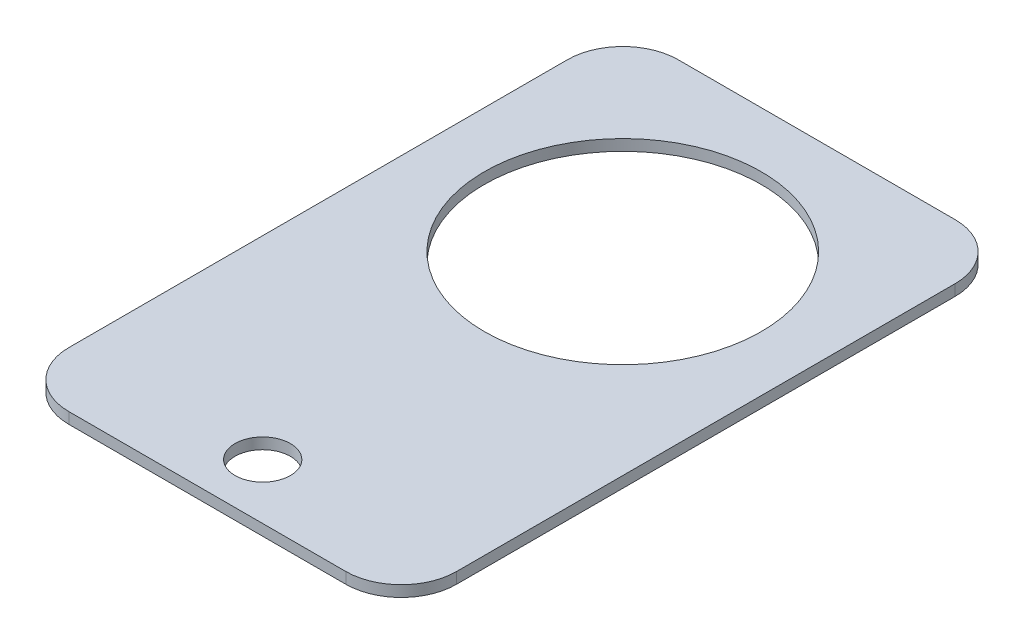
ISO-10303-21;
HEADER;
FILE_DESCRIPTION(('STEP AP214'),'2;1');
FILE_NAME('part.step','',(''),(''),'','','');
FILE_SCHEMA(('AUTOMOTIVE_DESIGN { 1 0 10303 214 1 1 1 1 }'));
ENDSEC;
DATA;
#1=APPLICATION_CONTEXT('core data for automotive mechanical design processes');
#2=APPLICATION_PROTOCOL_DEFINITION('international standard','automotive_design',2000,#1);
#3=PRODUCT_CONTEXT('',#1,'mechanical');
#4=PRODUCT('Part','Part','',(#3));
#5=PRODUCT_RELATED_PRODUCT_CATEGORY('part','',(#4));
#6=PRODUCT_DEFINITION_FORMATION('','',#4);
#7=PRODUCT_DEFINITION_CONTEXT('part definition',#1,'design');
#8=PRODUCT_DEFINITION('design','',#6,#7);
#9=PRODUCT_DEFINITION_SHAPE('','',#8);
#10=(LENGTH_UNIT() NAMED_UNIT(*) SI_UNIT(.MILLI.,.METRE.));
#11=(NAMED_UNIT(*) PLANE_ANGLE_UNIT() SI_UNIT($,.RADIAN.));
#12=(NAMED_UNIT(*) SI_UNIT($,.STERADIAN.) SOLID_ANGLE_UNIT());
#13=UNCERTAINTY_MEASURE_WITH_UNIT(LENGTH_MEASURE(1.E-05),#10,'distance_accuracy_value','');
#14=(GEOMETRIC_REPRESENTATION_CONTEXT(3) GLOBAL_UNCERTAINTY_ASSIGNED_CONTEXT((#13)) GLOBAL_UNIT_ASSIGNED_CONTEXT((#10,
#11,#12)) REPRESENTATION_CONTEXT('',''));
#15=CARTESIAN_POINT('',(0.,0.,0.));
#16=DIRECTION('',(0.,0.,1.));
#17=DIRECTION('',(1.,0.,0.));
#18=AXIS2_PLACEMENT_3D('',#15,#16,#17);
#19=CARTESIAN_POINT('',(0.,2.,0.));
#20=DIRECTION('',(1.,0.,0.));
#21=DIRECTION('',(0.,0.,-1.));
#22=AXIS2_PLACEMENT_3D('',#19,#20,#21);
#23=PLANE('',#22);
#24=DIRECTION('',(0.,0.,1.));
#25=VECTOR('',#24,1.);
#26=CARTESIAN_POINT('',(0.,2.,0.));
#27=LINE('',#26,#25);
#28=CARTESIAN_POINT('',(0.,2.,-100.));
#29=VERTEX_POINT('',#28);
#30=CARTESIAN_POINT('',(0.,2.,-10.));
#31=VERTEX_POINT('',#30);
#32=EDGE_CURVE('E134',#29,#31,#27,.T.);
#33=ORIENTED_EDGE('',*,*,#32,.F.);
#34=DIRECTION('',(0.,-1.,0.));
#35=VECTOR('',#34,1.);
#36=CARTESIAN_POINT('',(0.,2.,-100.));
#37=LINE('',#36,#35);
#38=CARTESIAN_POINT('',(0.,0.,-100.));
#39=VERTEX_POINT('',#38);
#40=EDGE_CURVE('E173',#29,#39,#37,.T.);
#41=ORIENTED_EDGE('',*,*,#40,.T.);
#42=DIRECTION('',(0.,0.,1.));
#43=VECTOR('',#42,1.);
#44=CARTESIAN_POINT('',(0.,0.,0.));
#45=LINE('',#44,#43);
#46=CARTESIAN_POINT('',(0.,0.,-10.));
#47=VERTEX_POINT('',#46);
#48=EDGE_CURVE('E188',#39,#47,#45,.T.);
#49=ORIENTED_EDGE('',*,*,#48,.T.);
#50=DIRECTION('',(0.,-1.,0.));
#51=VECTOR('',#50,1.);
#52=CARTESIAN_POINT('',(0.,2.,-10.));
#53=LINE('',#52,#51);
#54=EDGE_CURVE('E170',#47,#31,#53,.F.);
#55=ORIENTED_EDGE('',*,*,#54,.T.);
#56=EDGE_LOOP('',(#33,#41,#49,#55));
#57=FACE_BOUND('',#56,.T.);
#58=ADVANCED_FACE('F38',(#57),#23,.F.);
#59=CARTESIAN_POINT('',(0.,2.,0.));
#60=DIRECTION('',(0.,0.,-1.));
#61=DIRECTION('',(-1.,0.,0.));
#62=AXIS2_PLACEMENT_3D('',#59,#60,#61);
#63=PLANE('',#62);
#64=DIRECTION('',(1.,0.,0.));
#65=VECTOR('',#64,1.);
#66=CARTESIAN_POINT('',(0.,2.,0.));
#67=LINE('',#66,#65);
#68=CARTESIAN_POINT('',(10.,2.,0.));
#69=VERTEX_POINT('',#68);
#70=CARTESIAN_POINT('',(60.,2.,0.));
#71=VERTEX_POINT('',#70);
#72=EDGE_CURVE('E139',#69,#71,#67,.T.);
#73=ORIENTED_EDGE('',*,*,#72,.F.);
#74=DIRECTION('',(0.,-1.,0.));
#75=VECTOR('',#74,1.);
#76=CARTESIAN_POINT('',(10.,2.,0.));
#77=LINE('',#76,#75);
#78=CARTESIAN_POINT('',(10.,0.,0.));
#79=VERTEX_POINT('',#78);
#80=EDGE_CURVE('E11',#69,#79,#77,.T.);
#81=ORIENTED_EDGE('',*,*,#80,.T.);
#82=DIRECTION('',(1.,0.,0.));
#83=VECTOR('',#82,1.);
#84=CARTESIAN_POINT('',(0.,0.,0.));
#85=LINE('',#84,#83);
#86=CARTESIAN_POINT('',(60.,0.,0.));
#87=VERTEX_POINT('',#86);
#88=EDGE_CURVE('E141',#79,#87,#85,.T.);
#89=ORIENTED_EDGE('',*,*,#88,.T.);
#90=DIRECTION('',(0.,-1.,0.));
#91=VECTOR('',#90,1.);
#92=CARTESIAN_POINT('',(60.,2.,0.));
#93=LINE('',#92,#91);
#94=EDGE_CURVE('E47',#87,#71,#93,.F.);
#95=ORIENTED_EDGE('',*,*,#94,.T.);
#96=EDGE_LOOP('',(#73,#81,#89,#95));
#97=FACE_BOUND('',#96,.T.);
#98=ADVANCED_FACE('F194',(#97),#63,.F.);
#99=CARTESIAN_POINT('',(70.,2.,0.));
#100=DIRECTION('',(-1.,0.,0.));
#101=DIRECTION('',(0.,0.,1.));
#102=AXIS2_PLACEMENT_3D('',#99,#100,#101);
#103=PLANE('',#102);
#104=DIRECTION('',(0.,0.,-1.));
#105=VECTOR('',#104,1.);
#106=CARTESIAN_POINT('',(70.,0.,0.));
#107=LINE('',#106,#105);
#108=CARTESIAN_POINT('',(70.,0.,-10.));
#109=VERTEX_POINT('',#108);
#110=CARTESIAN_POINT('',(70.,0.,-100.));
#111=VERTEX_POINT('',#110);
#112=EDGE_CURVE('E135',#109,#111,#107,.T.);
#113=ORIENTED_EDGE('',*,*,#112,.T.);
#114=DIRECTION('',(0.,-1.,0.));
#115=VECTOR('',#114,1.);
#116=CARTESIAN_POINT('',(70.,2.,-100.));
#117=LINE('',#116,#115);
#118=CARTESIAN_POINT('',(70.,2.,-100.));
#119=VERTEX_POINT('',#118);
#120=EDGE_CURVE('E110',#111,#119,#117,.F.);
#121=ORIENTED_EDGE('',*,*,#120,.T.);
#122=DIRECTION('',(0.,0.,-1.));
#123=VECTOR('',#122,1.);
#124=CARTESIAN_POINT('',(70.,2.,0.));
#125=LINE('',#124,#123);
#126=CARTESIAN_POINT('',(70.,2.,-10.));
#127=VERTEX_POINT('',#126);
#128=EDGE_CURVE('E179',#127,#119,#125,.T.);
#129=ORIENTED_EDGE('',*,*,#128,.F.);
#130=DIRECTION('',(0.,-1.,0.));
#131=VECTOR('',#130,1.);
#132=CARTESIAN_POINT('',(70.,2.,-10.));
#133=LINE('',#132,#131);
#134=EDGE_CURVE('E116',#127,#109,#133,.T.);
#135=ORIENTED_EDGE('',*,*,#134,.T.);
#136=EDGE_LOOP('',(#113,#121,#129,#135));
#137=FACE_BOUND('',#136,.T.);
#138=ADVANCED_FACE('F201',(#137),#103,.F.);
#139=CARTESIAN_POINT('',(0.,2.,-110.));
#140=DIRECTION('',(0.,0.,1.));
#141=DIRECTION('',(1.,0.,0.));
#142=AXIS2_PLACEMENT_3D('',#139,#140,#141);
#143=PLANE('',#142);
#144=DIRECTION('',(-1.,0.,0.));
#145=VECTOR('',#144,1.);
#146=CARTESIAN_POINT('',(0.,2.,-110.));
#147=LINE('',#146,#145);
#148=CARTESIAN_POINT('',(60.,2.,-110.));
#149=VERTEX_POINT('',#148);
#150=CARTESIAN_POINT('',(10.,2.,-110.));
#151=VERTEX_POINT('',#150);
#152=EDGE_CURVE('E126',#149,#151,#147,.T.);
#153=ORIENTED_EDGE('',*,*,#152,.F.);
#154=DIRECTION('',(0.,-1.,0.));
#155=VECTOR('',#154,1.);
#156=CARTESIAN_POINT('',(60.,2.,-110.));
#157=LINE('',#156,#155);
#158=CARTESIAN_POINT('',(60.,0.,-110.));
#159=VERTEX_POINT('',#158);
#160=EDGE_CURVE('E109',#149,#159,#157,.T.);
#161=ORIENTED_EDGE('',*,*,#160,.T.);
#162=DIRECTION('',(-1.,0.,0.));
#163=VECTOR('',#162,1.);
#164=CARTESIAN_POINT('',(0.,0.,-110.));
#165=LINE('',#164,#163);
#166=CARTESIAN_POINT('',(10.,0.,-110.));
#167=VERTEX_POINT('',#166);
#168=EDGE_CURVE('E123',#159,#167,#165,.T.);
#169=ORIENTED_EDGE('',*,*,#168,.T.);
#170=DIRECTION('',(0.,-1.,0.));
#171=VECTOR('',#170,1.);
#172=CARTESIAN_POINT('',(10.,2.,-110.));
#173=LINE('',#172,#171);
#174=EDGE_CURVE('E129',#167,#151,#173,.F.);
#175=ORIENTED_EDGE('',*,*,#174,.T.);
#176=EDGE_LOOP('',(#153,#161,#169,#175));
#177=FACE_BOUND('',#176,.T.);
#178=ADVANCED_FACE('F122',(#177),#143,.F.);
#179=CARTESIAN_POINT('',(0.,2.,0.));
#180=DIRECTION('',(0.,-1.,0.));
#181=DIRECTION('',(0.,0.,-1.));
#182=AXIS2_PLACEMENT_3D('',#179,#180,#181);
#183=PLANE('',#182);
#184=CARTESIAN_POINT('',(35.,2.,-75.));
#185=DIRECTION('',(0.,1.,0.));
#186=DIRECTION('',(0.,0.,1.));
#187=AXIS2_PLACEMENT_3D('',#184,#185,#186);
#188=CIRCLE('',#187,25.);
#189=CARTESIAN_POINT('',(35.,2.,-50.));
#190=VERTEX_POINT('',#189);
#191=EDGE_CURVE('E316',#190,#190,#188,.T.);
#192=ORIENTED_EDGE('',*,*,#191,.F.);
#193=EDGE_LOOP('',(#192));
#194=FACE_BOUND('',#193,.T.);
#195=CARTESIAN_POINT('',(35.,2.,-10.));
#196=DIRECTION('',(0.,1.,0.));
#197=DIRECTION('',(0.,0.,1.));
#198=AXIS2_PLACEMENT_3D('',#195,#196,#197);
#199=CIRCLE('',#198,5.);
#200=CARTESIAN_POINT('',(35.,2.,-5.00000000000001));
#201=VERTEX_POINT('',#200);
#202=EDGE_CURVE('E324',#201,#201,#199,.T.);
#203=ORIENTED_EDGE('',*,*,#202,.F.);
#204=EDGE_LOOP('',(#203));
#205=FACE_BOUND('',#204,.T.);
#206=ORIENTED_EDGE('',*,*,#128,.T.);
#207=CARTESIAN_POINT('',(60.,2.,-100.));
#208=DIRECTION('',(0.,-1.,0.));
#209=DIRECTION('',(0.,0.,-1.));
#210=AXIS2_PLACEMENT_3D('',#207,#208,#209);
#211=CIRCLE('',#210,10.);
#212=EDGE_CURVE('E167',#119,#149,#211,.F.);
#213=ORIENTED_EDGE('',*,*,#212,.T.);
#214=ORIENTED_EDGE('',*,*,#152,.T.);
#215=CARTESIAN_POINT('',(10.,2.,-100.));
#216=DIRECTION('',(0.,-1.,0.));
#217=DIRECTION('',(0.,0.,-1.));
#218=AXIS2_PLACEMENT_3D('',#215,#216,#217);
#219=CIRCLE('',#218,10.);
#220=EDGE_CURVE('E164',#151,#29,#219,.F.);
#221=ORIENTED_EDGE('',*,*,#220,.T.);
#222=ORIENTED_EDGE('',*,*,#32,.T.);
#223=CARTESIAN_POINT('',(10.,2.,-10.));
#224=DIRECTION('',(0.,-1.,0.));
#225=DIRECTION('',(0.,0.,-1.));
#226=AXIS2_PLACEMENT_3D('',#223,#224,#225);
#227=CIRCLE('',#226,10.);
#228=EDGE_CURVE('E60',#31,#69,#227,.F.);
#229=ORIENTED_EDGE('',*,*,#228,.T.);
#230=ORIENTED_EDGE('',*,*,#72,.T.);
#231=CARTESIAN_POINT('',(60.,2.,-10.));
#232=DIRECTION('',(0.,-1.,0.));
#233=DIRECTION('',(0.,0.,-1.));
#234=AXIS2_PLACEMENT_3D('',#231,#232,#233);
#235=CIRCLE('',#234,10.);
#236=EDGE_CURVE('E159',#71,#127,#235,.F.);
#237=ORIENTED_EDGE('',*,*,#236,.T.);
#238=EDGE_LOOP('',(#206,#213,#214,#221,#222,#229,#230,#237));
#239=FACE_BOUND('',#238,.T.);
#240=ADVANCED_FACE('F199',(#194,#205,#239),#183,.F.);
#241=CARTESIAN_POINT('',(0.,0.,0.));
#242=DIRECTION('',(0.,-1.,0.));
#243=DIRECTION('',(0.,0.,-1.));
#244=AXIS2_PLACEMENT_3D('',#241,#242,#243);
#245=PLANE('',#244);
#246=CARTESIAN_POINT('',(35.,0.,-75.));
#247=DIRECTION('',(0.,1.,0.));
#248=DIRECTION('',(0.,0.,1.));
#249=AXIS2_PLACEMENT_3D('',#246,#247,#248);
#250=CIRCLE('',#249,25.);
#251=CARTESIAN_POINT('',(35.,0.,-50.));
#252=VERTEX_POINT('',#251);
#253=EDGE_CURVE('E191',#252,#252,#250,.T.);
#254=ORIENTED_EDGE('',*,*,#253,.T.);
#255=EDGE_LOOP('',(#254));
#256=FACE_BOUND('',#255,.T.);
#257=CARTESIAN_POINT('',(35.,0.,-10.));
#258=DIRECTION('',(0.,1.,0.));
#259=DIRECTION('',(0.,0.,1.));
#260=AXIS2_PLACEMENT_3D('',#257,#258,#259);
#261=CIRCLE('',#260,5.);
#262=CARTESIAN_POINT('',(35.,0.,-5.00000000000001));
#263=VERTEX_POINT('',#262);
#264=EDGE_CURVE('E318',#263,#263,#261,.T.);
#265=ORIENTED_EDGE('',*,*,#264,.T.);
#266=EDGE_LOOP('',(#265));
#267=FACE_BOUND('',#266,.T.);
#268=ORIENTED_EDGE('',*,*,#168,.F.);
#269=CARTESIAN_POINT('',(60.,0.,-100.));
#270=DIRECTION('',(0.,-1.,0.));
#271=DIRECTION('',(0.,0.,-1.));
#272=AXIS2_PLACEMENT_3D('',#269,#270,#271);
#273=CIRCLE('',#272,10.);
#274=EDGE_CURVE('E105',#159,#111,#273,.T.);
#275=ORIENTED_EDGE('',*,*,#274,.T.);
#276=ORIENTED_EDGE('',*,*,#112,.F.);
#277=CARTESIAN_POINT('',(60.,0.,-10.));
#278=DIRECTION('',(0.,-1.,0.));
#279=DIRECTION('',(0.,0.,-1.));
#280=AXIS2_PLACEMENT_3D('',#277,#278,#279);
#281=CIRCLE('',#280,10.);
#282=EDGE_CURVE('E128',#109,#87,#281,.T.);
#283=ORIENTED_EDGE('',*,*,#282,.T.);
#284=ORIENTED_EDGE('',*,*,#88,.F.);
#285=CARTESIAN_POINT('',(10.,0.,-10.));
#286=DIRECTION('',(0.,-1.,0.));
#287=DIRECTION('',(0.,0.,-1.));
#288=AXIS2_PLACEMENT_3D('',#285,#286,#287);
#289=CIRCLE('',#288,10.);
#290=EDGE_CURVE('E149',#79,#47,#289,.T.);
#291=ORIENTED_EDGE('',*,*,#290,.T.);
#292=ORIENTED_EDGE('',*,*,#48,.F.);
#293=CARTESIAN_POINT('',(10.,0.,-100.));
#294=DIRECTION('',(0.,-1.,0.));
#295=DIRECTION('',(0.,0.,-1.));
#296=AXIS2_PLACEMENT_3D('',#293,#294,#295);
#297=CIRCLE('',#296,10.);
#298=EDGE_CURVE('E117',#39,#167,#297,.T.);
#299=ORIENTED_EDGE('',*,*,#298,.T.);
#300=EDGE_LOOP('',(#268,#275,#276,#283,#284,#291,#292,#299));
#301=FACE_BOUND('',#300,.T.);
#302=ADVANCED_FACE('F131',(#256,#267,#301),#245,.T.);
#303=CARTESIAN_POINT('',(35.,0.,-10.));
#304=DIRECTION('',(0.,1.,0.));
#305=DIRECTION('',(0.,0.,1.));
#306=AXIS2_PLACEMENT_3D('',#303,#304,#305);
#307=CYLINDRICAL_SURFACE('',#306,5.);
#308=ORIENTED_EDGE('',*,*,#264,.F.);
#309=EDGE_LOOP('',(#308));
#310=FACE_BOUND('',#309,.T.);
#311=ORIENTED_EDGE('',*,*,#202,.T.);
#312=EDGE_LOOP('',(#311));
#313=FACE_BOUND('',#312,.T.);
#314=ADVANCED_FACE('F261',(#310,#313),#307,.F.);
#315=CARTESIAN_POINT('',(35.,0.,-75.));
#316=DIRECTION('',(0.,1.,0.));
#317=DIRECTION('',(0.,0.,1.));
#318=AXIS2_PLACEMENT_3D('',#315,#316,#317);
#319=CYLINDRICAL_SURFACE('',#318,25.);
#320=ORIENTED_EDGE('',*,*,#253,.F.);
#321=EDGE_LOOP('',(#320));
#322=FACE_BOUND('',#321,.T.);
#323=ORIENTED_EDGE('',*,*,#191,.T.);
#324=EDGE_LOOP('',(#323));
#325=FACE_BOUND('',#324,.T.);
#326=ADVANCED_FACE('F221',(#322,#325),#319,.F.);
#327=CARTESIAN_POINT('',(60.,2.,-100.));
#328=DIRECTION('',(0.,-1.,0.));
#329=DIRECTION('',(0.,0.,-1.));
#330=AXIS2_PLACEMENT_3D('',#327,#328,#329);
#331=CYLINDRICAL_SURFACE('',#330,10.);
#332=ORIENTED_EDGE('',*,*,#212,.F.);
#333=ORIENTED_EDGE('',*,*,#120,.F.);
#334=ORIENTED_EDGE('',*,*,#274,.F.);
#335=ORIENTED_EDGE('',*,*,#160,.F.);
#336=EDGE_LOOP('',(#332,#333,#334,#335));
#337=FACE_BOUND('',#336,.T.);
#338=ADVANCED_FACE('F108',(#337),#331,.T.);
#339=CARTESIAN_POINT('',(10.,2.,-100.));
#340=DIRECTION('',(0.,-1.,0.));
#341=DIRECTION('',(0.,0.,-1.));
#342=AXIS2_PLACEMENT_3D('',#339,#340,#341);
#343=CYLINDRICAL_SURFACE('',#342,10.);
#344=ORIENTED_EDGE('',*,*,#220,.F.);
#345=ORIENTED_EDGE('',*,*,#174,.F.);
#346=ORIENTED_EDGE('',*,*,#298,.F.);
#347=ORIENTED_EDGE('',*,*,#40,.F.);
#348=EDGE_LOOP('',(#344,#345,#346,#347));
#349=FACE_BOUND('',#348,.T.);
#350=ADVANCED_FACE('F220',(#349),#343,.T.);
#351=CARTESIAN_POINT('',(10.,2.,-10.));
#352=DIRECTION('',(0.,-1.,0.));
#353=DIRECTION('',(0.,0.,-1.));
#354=AXIS2_PLACEMENT_3D('',#351,#352,#353);
#355=CYLINDRICAL_SURFACE('',#354,10.);
#356=ORIENTED_EDGE('',*,*,#228,.F.);
#357=ORIENTED_EDGE('',*,*,#54,.F.);
#358=ORIENTED_EDGE('',*,*,#290,.F.);
#359=ORIENTED_EDGE('',*,*,#80,.F.);
#360=EDGE_LOOP('',(#356,#357,#358,#359));
#361=FACE_BOUND('',#360,.T.);
#362=ADVANCED_FACE('F223',(#361),#355,.T.);
#363=CARTESIAN_POINT('',(60.,2.,-10.));
#364=DIRECTION('',(0.,-1.,0.));
#365=DIRECTION('',(0.,0.,-1.));
#366=AXIS2_PLACEMENT_3D('',#363,#364,#365);
#367=CYLINDRICAL_SURFACE('',#366,10.);
#368=ORIENTED_EDGE('',*,*,#236,.F.);
#369=ORIENTED_EDGE('',*,*,#94,.F.);
#370=ORIENTED_EDGE('',*,*,#282,.F.);
#371=ORIENTED_EDGE('',*,*,#134,.F.);
#372=EDGE_LOOP('',(#368,#369,#370,#371));
#373=FACE_BOUND('',#372,.T.);
#374=ADVANCED_FACE('F40',(#373),#367,.T.);
#375=CLOSED_SHELL('',(#58,#98,#138,#178,#240,#302,#314,#326,#338,#350,#362,#374));
#376=MANIFOLD_SOLID_BREP('B2',#375);
#377=ADVANCED_BREP_SHAPE_REPRESENTATION('',(#18,#376),#14);
#378=SHAPE_DEFINITION_REPRESENTATION(#9,#377);
ENDSEC;
END-ISO-10303-21;
